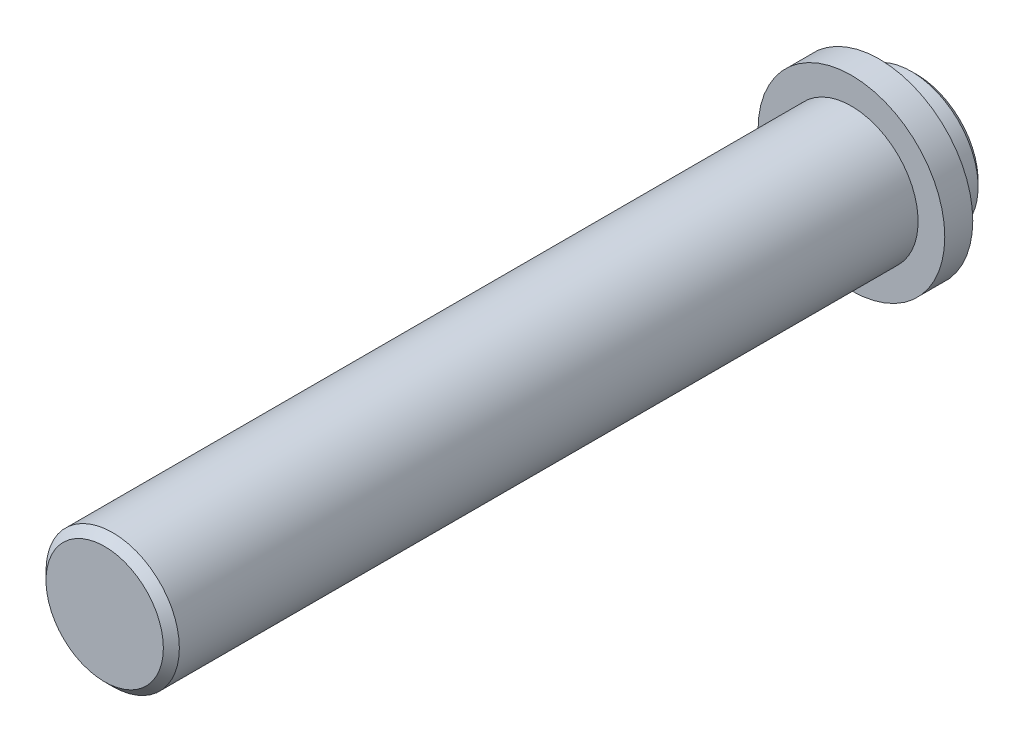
from build123d import *

# Parameters (mm, degrees)
ESQUISSE1_R             = 2.5
BASE_EXTRUSION_DEPTH    = 28
CHANFREIN1_SIZE         = 0.3
ESQUISSE2_R             = 3.5
BOSS_EXTRU_1_DEPTH      = 1.05
BOSS_EXTRU_2_START      = 1.4
ESQUISSE3_R             = 2.5
BOSS_EXTRU_2_DEPTH      = 1.4
CHANFREIN2_SIZE         = 0.2
ESQUISSE4_R             = 1.75
ENL_V_MAT_EXTRU_1_DEPTH = 1.25
ESQUISSE5_R             = 1.5
ENL_V_MAT_EXTRU_2_DEPTH = 13
CHANFREIN3_SIZE         = 0.15
ENL_V_MAT_EXTRU_3_DEPTH = 5


with BuildPart() as part:
    # Esquisse1 → Base-Extrusion (new body)
    with BuildSketch(Plane.XY):
        with Locations(Location((0, 0, 0), (0, 0, 180))):
            Circle(ESQUISSE1_R)
    extrude(amount=BASE_EXTRUSION_DEPTH)

    # Chanfrein1
    chanfrein1_edges = [part.edges().sort_by_distance(p)[0] for p in [
        (2.5, 0, 28),
    ]]
    chamfer(chanfrein1_edges, length=CHANFREIN1_SIZE)

    # Esquisse2 → Boss.-Extru.1 (add)
    with BuildSketch(Plane(origin=(0, 0, 0), x_dir=(-1, 0, 0), z_dir=(0, 0, -1))):
        Circle(ESQUISSE2_R)
    extrude(amount=BOSS_EXTRU_1_DEPTH)

    # Esquisse3 → Boss.-Extru.2 (add)
    with BuildSketch(Plane(origin=(0, 0, -1.05), x_dir=(-1, 0, 0), z_dir=(0, 0, -1)).offset(BOSS_EXTRU_2_START)):
        Circle(ESQUISSE3_R)
    extrude(amount=-BOSS_EXTRU_2_DEPTH)

    # Chanfrein2
    chanfrein2_edges = [part.edges().sort_by_distance(p)[0] for p in [
        (2.5, 0, -2.45),
    ]]
    chamfer(chanfrein2_edges, length=CHANFREIN2_SIZE)

    # Esquisse4 → Enl_v. mat.-Extru.1 (cut)
    with BuildSketch(Plane(origin=(0, 0, -2.45), x_dir=(-1, 0, 0), z_dir=(0, 0, -1))):
        Circle(ESQUISSE4_R)
    extrude(amount=-ENL_V_MAT_EXTRU_1_DEPTH, mode=Mode.SUBTRACT)

    # Esquisse5 → Enl_v. mat.-Extru.2 (cut)
    with BuildSketch(Plane(origin=(0, 0, -1.2), x_dir=(-1, 0, 0), z_dir=(0, 0, -1))):
        Circle(ESQUISSE5_R)
    extrude(amount=-ENL_V_MAT_EXTRU_2_DEPTH, mode=Mode.SUBTRACT)

    # Chanfrein3
    chanfrein3_edges = [part.edges().sort_by_distance(p)[0] for p in [
        (1.5, 0, -1.2),
    ]]
    chamfer(chanfrein3_edges, length=CHANFREIN3_SIZE)

    # Esquisse6 → Enl_v. mat.-Extru.3 (cut)
    with BuildSketch(Plane(origin=(0, 0, -1.2), x_dir=(-1, 0, 0), z_dir=(0, 0, -1))):
        Polygon((1.468776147, -0.917985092), (1.529386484, 0.81300491), (0.060610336, 1.730990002), (-1.468776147, 0.917985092), (-1.529386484, -0.81300491), (-0.060610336, -1.730990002), align=None)
    extrude(amount=-ENL_V_MAT_EXTRU_3_DEPTH, mode=Mode.SUBTRACT)


solid = part.part
